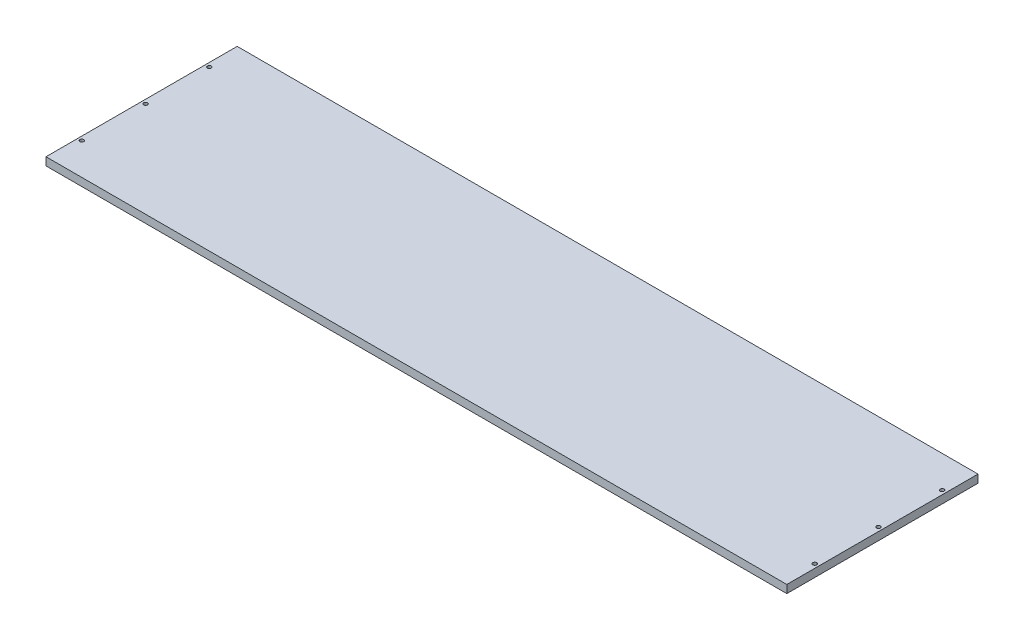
from build123d import *

# Parameters (mm, degrees)
SKETCH1_W                  = 590.55
SKETCH1_H                  = 152.4
BOSS_EXTRUDE1_DEPTH        = 6.35
F_31_0_12_DIAMETER_HOLE1_D = 3.048


with BuildPart() as part:
    # Sketch1 → Boss-Extrude1 (new body)
    with BuildSketch(Plane(origin=(0, 0, 0), x_dir=(1, 0, 0), z_dir=(0, 1, 0))):
        Rectangle(SKETCH1_W, SKETCH1_H)
    extrude(amount=BOSS_EXTRUDE1_DEPTH)

    # 31 _0.12_ Diameter Hole1 (through all)
    with Locations(Plane(origin=(0, 6.35, 0), x_dir=(1, 0, 0), z_dir=(0, 1, 0))):
        with Locations((-292.1, 50.8), (-292.1, -50.8), (-292.1, 0), (292.1, 0), (292.1, 50.8), (292.1, -50.8)):
            Hole(F_31_0_12_DIAMETER_HOLE1_D / 2)


solid = part.part
